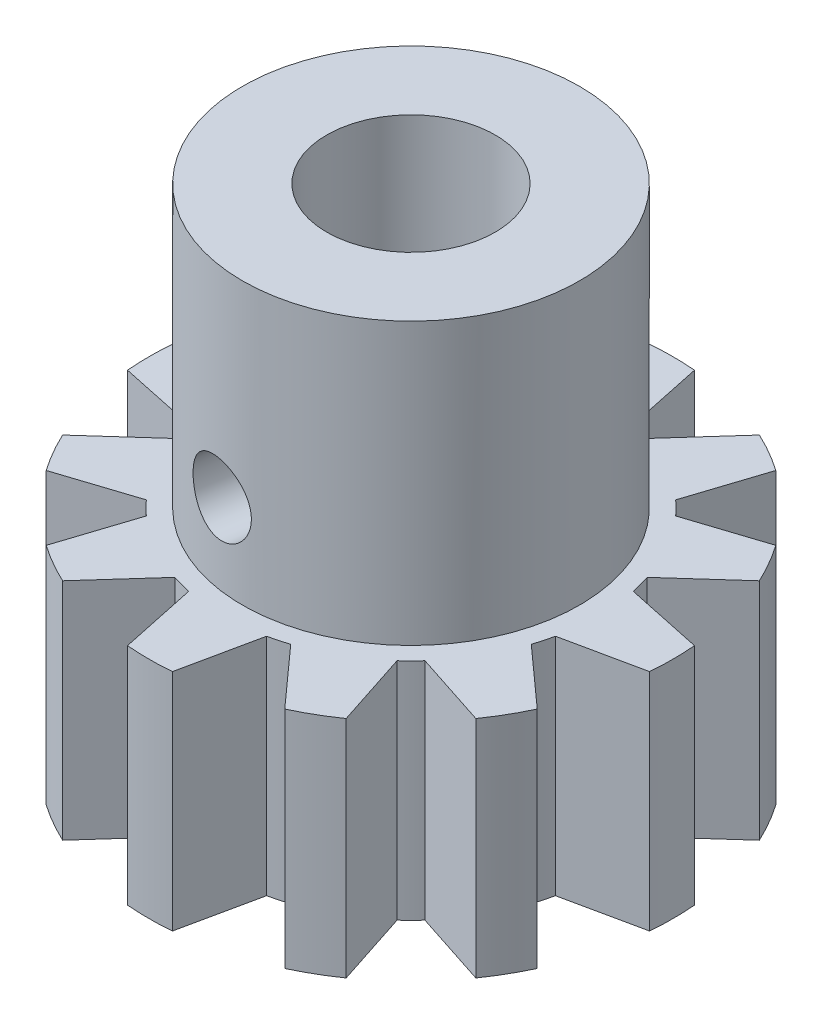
from build123d import *

# Parameters (mm, degrees)
SKETCH1_R               = 2.38125
BOSS_EXTRUDE1_DEPTH     = 6.35
SKETCH2_R               = 4.7625
SKETCH2_R_2             = 2.38125
BOSS_EXTRUDE2_DEPTH     = 7.9375
CUT_EXTRUDE1_DEPTH      = 30.260687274
CUT_EXTRUDE1_DEPTH_BACK = 30.260687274


with BuildPart() as part:
    # Sketch1 → Boss-Extrude1 (new body)
    with BuildSketch(Plane(origin=(0, 0, 0), x_dir=(1, 0, 0), z_dir=(0, 1, 0))):
        with BuildLine():
            Line((-0.635, 7.376819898), (-1.099800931, 5.180443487))
            ThreePointArc((-1.099800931, 5.180443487), (-1.370679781, 5.115446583), (-1.637766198, 5.036296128))
            Line((-1.637766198, 5.036296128), (-3.138483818, 6.706013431))
            ThreePointArc((-3.138483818, 6.706013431), (-3.70205, 6.412138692), (-4.23833608, 6.071013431))
            Line((-4.23833608, 6.071013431), (-3.542677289, 3.936495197))
            ThreePointArc((-3.542677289, 3.936495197), (-3.744766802, 3.744766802), (-3.936495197, 3.542677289))
            Line((-3.936495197, 3.542677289), (-6.071013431, 4.23833608))
            ThreePointArc((-6.071013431, 4.23833608), (-6.412138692, 3.70205), (-6.706013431, 3.138483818))
            Line((-6.706013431, 3.138483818), (-5.036296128, 1.637766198))
            ThreePointArc((-5.036296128, 1.637766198), (-5.115446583, 1.370679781), (-5.180443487, 1.099800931))
            Line((-5.180443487, 1.099800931), (-7.376819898, 0.635))
            ThreePointArc((-7.376819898, 0.635), (-7.4041, 0), (-7.376819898, -0.635))
            Line((-7.376819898, -0.635), (-5.180443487, -1.099800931))
            ThreePointArc((-5.180443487, -1.099800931), (-5.115446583, -1.370679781), (-5.036296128, -1.637766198))
            Line((-5.036296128, -1.637766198), (-6.706013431, -3.138483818))
            ThreePointArc((-6.706013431, -3.138483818), (-6.412138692, -3.70205), (-6.071013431, -4.23833608))
            Line((-6.071013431, -4.23833608), (-3.936495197, -3.542677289))
            ThreePointArc((-3.936495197, -3.542677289), (-3.744766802, -3.744766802), (-3.542677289, -3.936495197))
            Line((-3.542677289, -3.936495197), (-4.23833608, -6.071013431))
            ThreePointArc((-4.23833608, -6.071013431), (-3.70205, -6.412138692), (-3.138483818, -6.706013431))
            Line((-3.138483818, -6.706013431), (-1.637766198, -5.036296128))
            ThreePointArc((-1.637766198, -5.036296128), (-1.370679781, -5.115446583), (-1.099800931, -5.180443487))
            Line((-1.099800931, -5.180443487), (-0.635, -7.376819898))
            ThreePointArc((-0.635, -7.376819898), (0, -7.4041), (0.635, -7.376819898))
            Line((0.635, -7.376819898), (1.099800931, -5.180443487))
            ThreePointArc((1.099800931, -5.180443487), (1.370679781, -5.115446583), (1.637766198, -5.036296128))
            Line((1.637766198, -5.036296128), (3.138483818, -6.706013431))
            ThreePointArc((3.138483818, -6.706013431), (3.70205, -6.412138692), (4.23833608, -6.071013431))
            Line((4.23833608, -6.071013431), (3.542677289, -3.936495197))
            ThreePointArc((3.542677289, -3.936495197), (3.744766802, -3.744766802), (3.936495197, -3.542677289))
            Line((3.936495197, -3.542677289), (6.071013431, -4.23833608))
            ThreePointArc((6.071013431, -4.23833608), (6.412138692, -3.70205), (6.706013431, -3.138483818))
            Line((6.706013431, -3.138483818), (5.036296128, -1.637766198))
            ThreePointArc((5.036296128, -1.637766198), (5.115446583, -1.370679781), (5.180443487, -1.099800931))
            Line((5.180443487, -1.099800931), (7.376819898, -0.635))
            ThreePointArc((7.376819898, -0.635), (7.4041, 0), (7.376819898, 0.635))
            Line((7.376819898, 0.635), (5.180443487, 1.099800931))
            ThreePointArc((5.180443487, 1.099800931), (5.115446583, 1.370679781), (5.036296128, 1.637766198))
            Line((5.036296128, 1.637766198), (6.706013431, 3.138483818))
            ThreePointArc((6.706013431, 3.138483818), (6.412138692, 3.70205), (6.071013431, 4.23833608))
            Line((6.071013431, 4.23833608), (3.936495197, 3.542677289))
            ThreePointArc((3.936495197, 3.542677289), (3.744766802, 3.744766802), (3.542677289, 3.936495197))
            Line((3.542677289, 3.936495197), (4.23833608, 6.071013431))
            ThreePointArc((4.23833608, 6.071013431), (3.70205, 6.412138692), (3.138483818, 6.706013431))
            Line((3.138483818, 6.706013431), (1.637766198, 5.036296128))
            ThreePointArc((1.637766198, 5.036296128), (1.370679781, 5.115446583), (1.099800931, 5.180443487))
            Line((1.099800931, 5.180443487), (0.635, 7.376819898))
            ThreePointArc((0.635, 7.376819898), (0, 7.4041), (-0.635, 7.376819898))
        make_face()
        with Locations(Location((0, 0, 0), (0, 0, 270))):
            Circle(SKETCH1_R, mode=Mode.SUBTRACT)
    extrude(amount=BOSS_EXTRUDE1_DEPTH)

    # Sketch2 → Boss-Extrude2 (add)
    with BuildSketch(Plane(origin=(0, 6.35, 0), x_dir=(1, 0, 0), z_dir=(0, 1, 0))):
        with Locations(Location((0, 0, 0), (0, 0, 90))):
            Circle(SKETCH2_R)
        with Locations(Location((0, 0, 0), (0, 0, 270))):
            Circle(SKETCH2_R_2, mode=Mode.SUBTRACT)
    extrude(amount=BOSS_EXTRUDE2_DEPTH)

    # Sketch3 → Cut-Extrude1 (cut, two sides: drawn at the far end of the back side and taken through both)
    with BuildSketch(Plane(origin=(-15.448965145, 0, -3.98855452), x_dir=(0.987463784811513, 6.428477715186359e-12, 0.15784572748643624), z_dir=(-0.15784572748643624, 1.0890717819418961e-15, 0.987463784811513)).offset(-CUT_EXTRUDE1_DEPTH_BACK)):
        with BuildLine():
            add(Edge.make_bspline(
                [(15.884869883, 9.5646875), (15.752176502, 9.5646875), (15.622101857, 9.538037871), (15.382394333, 9.437848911), (15.273384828, 9.364250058), (15.092645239, 9.183370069), (15.019218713, 9.074208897), (14.919733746, 8.836272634), (14.892852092, 8.704884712), (14.892514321, 8.442671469), (14.918672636, 8.311712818), (15.019275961, 8.070211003), (15.092276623, 7.962038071), (15.273450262, 7.780645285), (15.382709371, 7.707081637), (15.620974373, 7.607371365), (15.752904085, 7.580479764), (16.014308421, 7.580146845), (16.146001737, 7.606474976), (16.386442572, 7.706579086), (16.49505479, 7.779535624), (16.67772915, 7.962178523), (16.750364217, 8.070353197), (16.850306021, 8.309507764), (16.876940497, 8.440753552), (16.877173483, 8.702479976), (16.850620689, 8.834298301), (16.751047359, 9.07344865), (16.678102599, 9.182275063), (16.496008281, 9.364682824), (16.38863488, 9.437291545), (16.146585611, 9.5384961), (16.017563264, 9.5646875), (15.884869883, 9.5646875)],
                knots=[0, 0, 0, 0, 0.0625, 0.0625, 0.125, 0.125, 0.1875, 0.1875, 0.25, 0.25, 0.3125, 0.3125, 0.375, 0.375, 0.4375, 0.4375, 0.5, 0.5, 0.5625, 0.5625, 0.625, 0.625, 0.6875, 0.6875, 0.75, 0.75, 0.8125, 0.8125, 0.875, 0.875, 0.9375, 0.9375, 1, 1, 1, 1], degree=3))
        make_face()
    extrude(amount=CUT_EXTRUDE1_DEPTH + CUT_EXTRUDE1_DEPTH_BACK, mode=Mode.SUBTRACT)


solid = part.part
